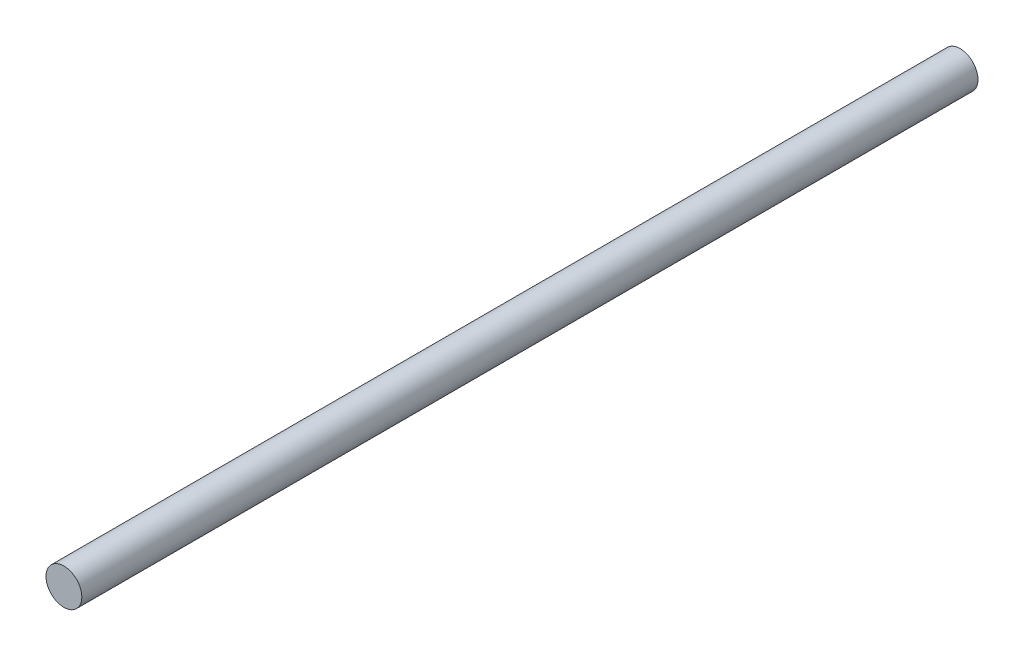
ISO-10303-21;
HEADER;
FILE_DESCRIPTION(('STEP AP214'),'2;1');
FILE_NAME('part.step','',(''),(''),'','','');
FILE_SCHEMA(('AUTOMOTIVE_DESIGN { 1 0 10303 214 1 1 1 1 }'));
ENDSEC;
DATA;
#1=APPLICATION_CONTEXT('core data for automotive mechanical design processes');
#2=APPLICATION_PROTOCOL_DEFINITION('international standard','automotive_design',2000,#1);
#3=PRODUCT_CONTEXT('',#1,'mechanical');
#4=PRODUCT('Part','Part','',(#3));
#5=PRODUCT_RELATED_PRODUCT_CATEGORY('part','',(#4));
#6=PRODUCT_DEFINITION_FORMATION('','',#4);
#7=PRODUCT_DEFINITION_CONTEXT('part definition',#1,'design');
#8=PRODUCT_DEFINITION('design','',#6,#7);
#9=PRODUCT_DEFINITION_SHAPE('','',#8);
#10=(LENGTH_UNIT() NAMED_UNIT(*) SI_UNIT(.MILLI.,.METRE.));
#11=(NAMED_UNIT(*) PLANE_ANGLE_UNIT() SI_UNIT($,.RADIAN.));
#12=(NAMED_UNIT(*) SI_UNIT($,.STERADIAN.) SOLID_ANGLE_UNIT());
#13=UNCERTAINTY_MEASURE_WITH_UNIT(LENGTH_MEASURE(1.E-05),#10,'distance_accuracy_value','');
#14=(GEOMETRIC_REPRESENTATION_CONTEXT(3) GLOBAL_UNCERTAINTY_ASSIGNED_CONTEXT((#13)) GLOBAL_UNIT_ASSIGNED_CONTEXT((#10,
#11,#12)) REPRESENTATION_CONTEXT('',''));
#15=CARTESIAN_POINT('',(0.,0.,0.));
#16=DIRECTION('',(0.,0.,1.));
#17=DIRECTION('',(1.,0.,0.));
#18=AXIS2_PLACEMENT_3D('',#15,#16,#17);
#19=CARTESIAN_POINT('',(0.,0.,-1500.));
#20=DIRECTION('',(0.,0.,1.));
#21=DIRECTION('',(1.,0.,0.));
#22=AXIS2_PLACEMENT_3D('',#19,#20,#21);
#23=CYLINDRICAL_SURFACE('',#22,30.);
#24=CARTESIAN_POINT('',(0.,0.,-1500.));
#25=DIRECTION('',(0.,0.,1.));
#26=DIRECTION('',(1.,0.,0.));
#27=AXIS2_PLACEMENT_3D('',#24,#25,#26);
#28=CIRCLE('',#27,30.);
#29=CARTESIAN_POINT('',(30.,0.,-1500.));
#30=VERTEX_POINT('',#29);
#31=EDGE_CURVE('E10',#30,#30,#28,.T.);
#32=ORIENTED_EDGE('',*,*,#31,.T.);
#33=EDGE_LOOP('',(#32));
#34=FACE_BOUND('',#33,.T.);
#35=CARTESIAN_POINT('',(0.,0.,0.));
#36=DIRECTION('',(0.,0.,1.));
#37=DIRECTION('',(1.,0.,0.));
#38=AXIS2_PLACEMENT_3D('',#35,#36,#37);
#39=CIRCLE('',#38,30.);
#40=CARTESIAN_POINT('',(30.,0.,0.));
#41=VERTEX_POINT('',#40);
#42=EDGE_CURVE('E40',#41,#41,#39,.T.);
#43=ORIENTED_EDGE('',*,*,#42,.F.);
#44=EDGE_LOOP('',(#43));
#45=FACE_BOUND('',#44,.T.);
#46=ADVANCED_FACE('F37',(#34,#45),#23,.T.);
#47=CARTESIAN_POINT('',(0.,0.,-1500.));
#48=DIRECTION('',(0.,0.,1.));
#49=DIRECTION('',(1.,0.,0.));
#50=AXIS2_PLACEMENT_3D('',#47,#48,#49);
#51=PLANE('',#50);
#52=ORIENTED_EDGE('',*,*,#31,.F.);
#53=EDGE_LOOP('',(#52));
#54=FACE_BOUND('',#53,.T.);
#55=ADVANCED_FACE('F54',(#54),#51,.F.);
#56=CARTESIAN_POINT('',(0.,0.,0.));
#57=DIRECTION('',(0.,0.,1.));
#58=DIRECTION('',(1.,0.,0.));
#59=AXIS2_PLACEMENT_3D('',#56,#57,#58);
#60=PLANE('',#59);
#61=ORIENTED_EDGE('',*,*,#42,.T.);
#62=EDGE_LOOP('',(#61));
#63=FACE_BOUND('',#62,.T.);
#64=ADVANCED_FACE('F51',(#63),#60,.T.);
#65=CLOSED_SHELL('',(#46,#55,#64));
#66=MANIFOLD_SOLID_BREP('B2',#65);
#67=ADVANCED_BREP_SHAPE_REPRESENTATION('',(#18,#66),#14);
#68=SHAPE_DEFINITION_REPRESENTATION(#9,#67);
ENDSEC;
END-ISO-10303-21;
